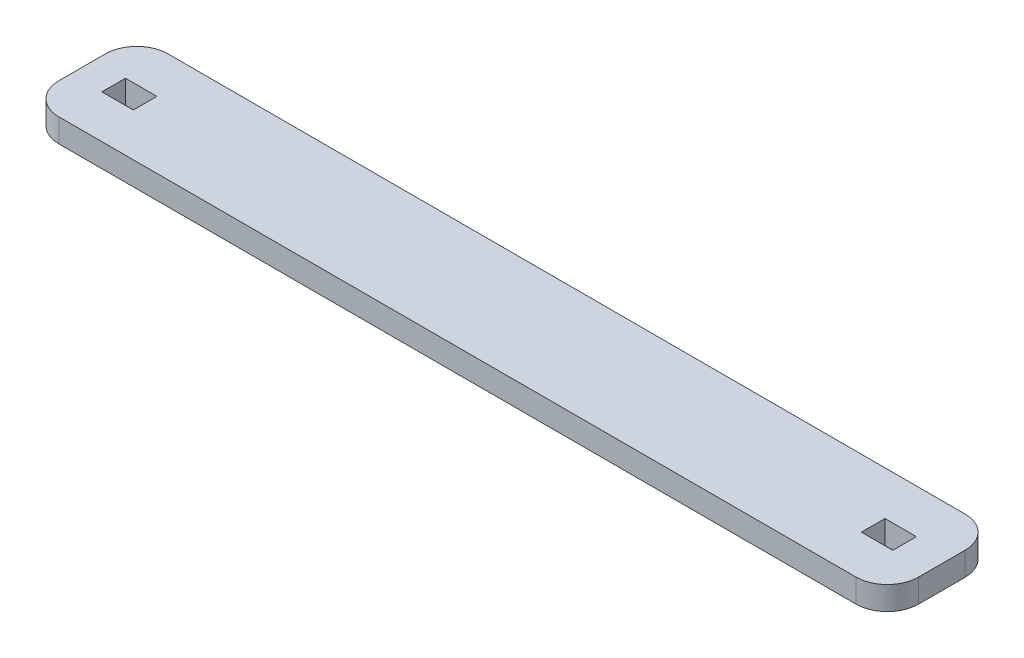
ISO-10303-21;
HEADER;
FILE_DESCRIPTION(('STEP AP214'),'2;1');
FILE_NAME('part.step','',(''),(''),'','','');
FILE_SCHEMA(('AUTOMOTIVE_DESIGN { 1 0 10303 214 1 1 1 1 }'));
ENDSEC;
DATA;
#1=APPLICATION_CONTEXT('core data for automotive mechanical design processes');
#2=APPLICATION_PROTOCOL_DEFINITION('international standard','automotive_design',2000,#1);
#3=PRODUCT_CONTEXT('',#1,'mechanical');
#4=PRODUCT('Part','Part','',(#3));
#5=PRODUCT_RELATED_PRODUCT_CATEGORY('part','',(#4));
#6=PRODUCT_DEFINITION_FORMATION('','',#4);
#7=PRODUCT_DEFINITION_CONTEXT('part definition',#1,'design');
#8=PRODUCT_DEFINITION('design','',#6,#7);
#9=PRODUCT_DEFINITION_SHAPE('','',#8);
#10=(LENGTH_UNIT() NAMED_UNIT(*) SI_UNIT(.MILLI.,.METRE.));
#11=(NAMED_UNIT(*) PLANE_ANGLE_UNIT() SI_UNIT($,.RADIAN.));
#12=(NAMED_UNIT(*) SI_UNIT($,.STERADIAN.) SOLID_ANGLE_UNIT());
#13=UNCERTAINTY_MEASURE_WITH_UNIT(LENGTH_MEASURE(1.E-05),#10,'distance_accuracy_value','');
#14=(GEOMETRIC_REPRESENTATION_CONTEXT(3) GLOBAL_UNCERTAINTY_ASSIGNED_CONTEXT((#13)) GLOBAL_UNIT_ASSIGNED_CONTEXT((#10,
#11,#12)) REPRESENTATION_CONTEXT('',''));
#15=CARTESIAN_POINT('',(0.,0.,0.));
#16=DIRECTION('',(0.,0.,1.));
#17=DIRECTION('',(1.,0.,0.));
#18=AXIS2_PLACEMENT_3D('',#15,#16,#17);
#19=CARTESIAN_POINT('',(270.47619047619,7.5,-28.8095238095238));
#20=DIRECTION('',(0.,-1.,0.));
#21=DIRECTION('',(0.,0.,-1.));
#22=AXIS2_PLACEMENT_3D('',#19,#20,#21);
#23=PLANE('',#22);
#24=DIRECTION('',(0.,0.,1.));
#25=VECTOR('',#24,1.);
#26=CARTESIAN_POINT('',(-239.610659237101,7.5,-21.7145058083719));
#27=LINE('',#26,#25);
#28=CARTESIAN_POINT('',(-239.610659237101,7.5,-21.7145058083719));
#29=VERTEX_POINT('',#28);
#30=CARTESIAN_POINT('',(-239.610659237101,7.5,-6.61450580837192));
#31=VERTEX_POINT('',#30);
#32=EDGE_CURVE('E182',#29,#31,#27,.T.);
#33=ORIENTED_EDGE('',*,*,#32,.F.);
#34=DIRECTION('',(-1.,0.,0.));
#35=VECTOR('',#34,1.);
#36=CARTESIAN_POINT('',(-239.610659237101,7.5,-21.7145058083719));
#37=LINE('',#36,#35);
#38=CARTESIAN_POINT('',(-219.510659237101,7.5,-21.7145058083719));
#39=VERTEX_POINT('',#38);
#40=EDGE_CURVE('E190',#39,#29,#37,.T.);
#41=ORIENTED_EDGE('',*,*,#40,.F.);
#42=DIRECTION('',(0.,0.,-1.));
#43=VECTOR('',#42,1.);
#44=CARTESIAN_POINT('',(-219.510659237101,7.5,-21.7145058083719));
#45=LINE('',#44,#43);
#46=CARTESIAN_POINT('',(-219.510659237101,7.5,-6.61450580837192));
#47=VERTEX_POINT('',#46);
#48=EDGE_CURVE('E187',#47,#39,#45,.T.);
#49=ORIENTED_EDGE('',*,*,#48,.F.);
#50=DIRECTION('',(1.,0.,0.));
#51=VECTOR('',#50,1.);
#52=CARTESIAN_POINT('',(-239.610659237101,7.5,-6.61450580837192));
#53=LINE('',#52,#51);
#54=EDGE_CURVE('E184',#31,#47,#53,.T.);
#55=ORIENTED_EDGE('',*,*,#54,.F.);
#56=EDGE_LOOP('',(#33,#41,#49,#55));
#57=FACE_BOUND('',#56,.T.);
#58=CARTESIAN_POINT('',(270.47619047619,7.5,-28.8095238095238));
#59=DIRECTION('',(0.,1.,0.));
#60=DIRECTION('',(0.,0.,-1.));
#61=AXIS2_PLACEMENT_3D('',#58,#59,#60);
#62=CIRCLE('',#61,20.);
#63=CARTESIAN_POINT('',(290.47619047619,7.5,-28.8095238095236));
#64=VERTEX_POINT('',#63);
#65=CARTESIAN_POINT('',(270.47619047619,7.5,-48.8095238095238));
#66=VERTEX_POINT('',#65);
#67=EDGE_CURVE('E213',#64,#66,#62,.T.);
#68=ORIENTED_EDGE('',*,*,#67,.T.);
#69=DIRECTION('',(-1.,0.,0.));
#70=VECTOR('',#69,1.);
#71=CARTESIAN_POINT('',(-239.523809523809,7.5,-48.8095238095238));
#72=LINE('',#71,#70);
#73=CARTESIAN_POINT('',(-239.523809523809,7.5,-48.8095238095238));
#74=VERTEX_POINT('',#73);
#75=EDGE_CURVE('E216',#66,#74,#72,.T.);
#76=ORIENTED_EDGE('',*,*,#75,.T.);
#77=CARTESIAN_POINT('',(-239.52380952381,7.5,-28.8095238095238));
#78=DIRECTION('',(0.,1.,0.));
#79=DIRECTION('',(0.,0.,1.));
#80=AXIS2_PLACEMENT_3D('',#77,#78,#79);
#81=CIRCLE('',#80,20.);
#82=CARTESIAN_POINT('',(-259.52380952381,7.5,-28.8095238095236));
#83=VERTEX_POINT('',#82);
#84=EDGE_CURVE('E219',#74,#83,#81,.T.);
#85=ORIENTED_EDGE('',*,*,#84,.T.);
#86=DIRECTION('',(0.,0.,1.));
#87=VECTOR('',#86,1.);
#88=CARTESIAN_POINT('',(-259.52380952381,7.5,-28.8095238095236));
#89=LINE('',#88,#87);
#90=CARTESIAN_POINT('',(-259.52380952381,7.5,0.990476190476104));
#91=VERTEX_POINT('',#90);
#92=EDGE_CURVE('E221',#83,#91,#89,.T.);
#93=ORIENTED_EDGE('',*,*,#92,.T.);
#94=CARTESIAN_POINT('',(-239.52380952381,7.5,0.990476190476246));
#95=DIRECTION('',(0.,1.,0.));
#96=DIRECTION('',(0.,0.,1.));
#97=AXIS2_PLACEMENT_3D('',#94,#95,#96);
#98=CIRCLE('',#97,20.);
#99=CARTESIAN_POINT('',(-239.52380952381,7.5,20.9904761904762));
#100=VERTEX_POINT('',#99);
#101=EDGE_CURVE('E223',#91,#100,#98,.T.);
#102=ORIENTED_EDGE('',*,*,#101,.T.);
#103=DIRECTION('',(1.,0.,0.));
#104=VECTOR('',#103,1.);
#105=CARTESIAN_POINT('',(-239.523809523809,7.5,20.9904761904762));
#106=LINE('',#105,#104);
#107=CARTESIAN_POINT('',(270.47619047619,7.5,20.9904761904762));
#108=VERTEX_POINT('',#107);
#109=EDGE_CURVE('E225',#100,#108,#106,.T.);
#110=ORIENTED_EDGE('',*,*,#109,.T.);
#111=CARTESIAN_POINT('',(270.47619047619,7.5,0.990476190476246));
#112=DIRECTION('',(0.,1.,0.));
#113=DIRECTION('',(0.,0.,1.));
#114=AXIS2_PLACEMENT_3D('',#111,#112,#113);
#115=CIRCLE('',#114,20.);
#116=CARTESIAN_POINT('',(290.47619047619,7.5,0.990476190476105));
#117=VERTEX_POINT('',#116);
#118=EDGE_CURVE('E227',#108,#117,#115,.T.);
#119=ORIENTED_EDGE('',*,*,#118,.T.);
#120=DIRECTION('',(0.,0.,-1.));
#121=VECTOR('',#120,1.);
#122=CARTESIAN_POINT('',(290.47619047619,7.5,-28.8095238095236));
#123=LINE('',#122,#121);
#124=EDGE_CURVE('E229',#117,#64,#123,.T.);
#125=ORIENTED_EDGE('',*,*,#124,.T.);
#126=EDGE_LOOP('',(#68,#76,#85,#93,#102,#110,#119,#125));
#127=FACE_BOUND('',#126,.T.);
#128=DIRECTION('',(0.,0.,1.));
#129=VECTOR('',#128,1.);
#130=CARTESIAN_POINT('',(247.285233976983,7.5,-20.7145058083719));
#131=LINE('',#130,#129);
#132=CARTESIAN_POINT('',(247.285233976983,7.5,-20.7145058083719));
#133=VERTEX_POINT('',#132);
#134=CARTESIAN_POINT('',(247.285233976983,7.5,-5.61450580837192));
#135=VERTEX_POINT('',#134);
#136=EDGE_CURVE('E146',#133,#135,#131,.T.);
#137=ORIENTED_EDGE('',*,*,#136,.F.);
#138=DIRECTION('',(-1.,0.,0.));
#139=VECTOR('',#138,1.);
#140=CARTESIAN_POINT('',(247.285233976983,7.5,-20.7145058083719));
#141=LINE('',#140,#139);
#142=CARTESIAN_POINT('',(267.385233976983,7.5,-20.7145058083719));
#143=VERTEX_POINT('',#142);
#144=EDGE_CURVE('E168',#143,#133,#141,.T.);
#145=ORIENTED_EDGE('',*,*,#144,.F.);
#146=DIRECTION('',(0.,0.,-1.));
#147=VECTOR('',#146,1.);
#148=CARTESIAN_POINT('',(267.385233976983,7.5,-20.7145058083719));
#149=LINE('',#148,#147);
#150=CARTESIAN_POINT('',(267.385233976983,7.5,-5.61450580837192));
#151=VERTEX_POINT('',#150);
#152=EDGE_CURVE('E166',#151,#143,#149,.T.);
#153=ORIENTED_EDGE('',*,*,#152,.F.);
#154=DIRECTION('',(1.,0.,0.));
#155=VECTOR('',#154,1.);
#156=CARTESIAN_POINT('',(247.285233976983,7.5,-5.61450580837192));
#157=LINE('',#156,#155);
#158=EDGE_CURVE('E154',#135,#151,#157,.T.);
#159=ORIENTED_EDGE('',*,*,#158,.F.);
#160=EDGE_LOOP('',(#137,#145,#153,#159));
#161=FACE_BOUND('',#160,.T.);
#162=ADVANCED_FACE('F33',(#57,#127,#161),#23,.F.);
#163=CARTESIAN_POINT('',(270.47619047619,-7.5,-28.8095238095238));
#164=DIRECTION('',(0.,-1.,0.));
#165=DIRECTION('',(0.,0.,-1.));
#166=AXIS2_PLACEMENT_3D('',#163,#164,#165);
#167=PLANE('',#166);
#168=CARTESIAN_POINT('',(270.47619047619,-7.5,-28.8095238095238));
#169=DIRECTION('',(0.,1.,0.));
#170=DIRECTION('',(0.,0.,-1.));
#171=AXIS2_PLACEMENT_3D('',#168,#169,#170);
#172=CIRCLE('',#171,20.);
#173=CARTESIAN_POINT('',(290.47619047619,-7.5,-28.8095238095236));
#174=VERTEX_POINT('',#173);
#175=CARTESIAN_POINT('',(270.47619047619,-7.5,-48.8095238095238));
#176=VERTEX_POINT('',#175);
#177=EDGE_CURVE('E212',#174,#176,#172,.T.);
#178=ORIENTED_EDGE('',*,*,#177,.F.);
#179=DIRECTION('',(0.,0.,-1.));
#180=VECTOR('',#179,1.);
#181=CARTESIAN_POINT('',(290.47619047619,-7.5,-28.8095238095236));
#182=LINE('',#181,#180);
#183=CARTESIAN_POINT('',(290.47619047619,-7.5,0.990476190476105));
#184=VERTEX_POINT('',#183);
#185=EDGE_CURVE('E217',#184,#174,#182,.T.);
#186=ORIENTED_EDGE('',*,*,#185,.F.);
#187=CARTESIAN_POINT('',(270.47619047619,-7.5,0.990476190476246));
#188=DIRECTION('',(0.,1.,0.));
#189=DIRECTION('',(0.,0.,1.));
#190=AXIS2_PLACEMENT_3D('',#187,#188,#189);
#191=CIRCLE('',#190,20.);
#192=CARTESIAN_POINT('',(270.47619047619,-7.5,20.9904761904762));
#193=VERTEX_POINT('',#192);
#194=EDGE_CURVE('E244',#193,#184,#191,.T.);
#195=ORIENTED_EDGE('',*,*,#194,.F.);
#196=DIRECTION('',(1.,0.,0.));
#197=VECTOR('',#196,1.);
#198=CARTESIAN_POINT('',(-239.523809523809,-7.5,20.9904761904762));
#199=LINE('',#198,#197);
#200=CARTESIAN_POINT('',(-239.52380952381,-7.5,20.9904761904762));
#201=VERTEX_POINT('',#200);
#202=EDGE_CURVE('E242',#201,#193,#199,.T.);
#203=ORIENTED_EDGE('',*,*,#202,.F.);
#204=CARTESIAN_POINT('',(-239.52380952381,-7.5,0.990476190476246));
#205=DIRECTION('',(0.,1.,0.));
#206=DIRECTION('',(0.,0.,1.));
#207=AXIS2_PLACEMENT_3D('',#204,#205,#206);
#208=CIRCLE('',#207,20.);
#209=CARTESIAN_POINT('',(-259.52380952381,-7.5,0.990476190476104));
#210=VERTEX_POINT('',#209);
#211=EDGE_CURVE('E240',#210,#201,#208,.T.);
#212=ORIENTED_EDGE('',*,*,#211,.F.);
#213=DIRECTION('',(0.,0.,1.));
#214=VECTOR('',#213,1.);
#215=CARTESIAN_POINT('',(-259.52380952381,-7.5,-28.8095238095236));
#216=LINE('',#215,#214);
#217=CARTESIAN_POINT('',(-259.52380952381,-7.5,-28.8095238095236));
#218=VERTEX_POINT('',#217);
#219=EDGE_CURVE('E238',#218,#210,#216,.T.);
#220=ORIENTED_EDGE('',*,*,#219,.F.);
#221=CARTESIAN_POINT('',(-239.52380952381,-7.5,-28.8095238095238));
#222=DIRECTION('',(0.,1.,0.));
#223=DIRECTION('',(0.,0.,1.));
#224=AXIS2_PLACEMENT_3D('',#221,#222,#223);
#225=CIRCLE('',#224,20.);
#226=CARTESIAN_POINT('',(-239.523809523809,-7.5,-48.8095238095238));
#227=VERTEX_POINT('',#226);
#228=EDGE_CURVE('E236',#227,#218,#225,.T.);
#229=ORIENTED_EDGE('',*,*,#228,.F.);
#230=DIRECTION('',(-1.,0.,0.));
#231=VECTOR('',#230,1.);
#232=CARTESIAN_POINT('',(-239.523809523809,-7.5,-48.8095238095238));
#233=LINE('',#232,#231);
#234=EDGE_CURVE('E234',#176,#227,#233,.T.);
#235=ORIENTED_EDGE('',*,*,#234,.F.);
#236=EDGE_LOOP('',(#178,#186,#195,#203,#212,#220,#229,#235));
#237=FACE_BOUND('',#236,.T.);
#238=DIRECTION('',(-1.,0.,0.));
#239=VECTOR('',#238,1.);
#240=CARTESIAN_POINT('',(-239.610659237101,-7.5,-21.7145058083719));
#241=LINE('',#240,#239);
#242=CARTESIAN_POINT('',(-219.510659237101,-7.5,-21.7145058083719));
#243=VERTEX_POINT('',#242);
#244=CARTESIAN_POINT('',(-239.610659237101,-7.5,-21.7145058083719));
#245=VERTEX_POINT('',#244);
#246=EDGE_CURVE('E185',#243,#245,#241,.T.);
#247=ORIENTED_EDGE('',*,*,#246,.T.);
#248=DIRECTION('',(0.,0.,1.));
#249=VECTOR('',#248,1.);
#250=CARTESIAN_POINT('',(-239.610659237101,-7.5,-21.7145058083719));
#251=LINE('',#250,#249);
#252=CARTESIAN_POINT('',(-239.610659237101,-7.5,-6.61450580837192));
#253=VERTEX_POINT('',#252);
#254=EDGE_CURVE('E162',#245,#253,#251,.T.);
#255=ORIENTED_EDGE('',*,*,#254,.T.);
#256=DIRECTION('',(1.,0.,0.));
#257=VECTOR('',#256,1.);
#258=CARTESIAN_POINT('',(-239.610659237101,-7.5,-6.61450580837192));
#259=LINE('',#258,#257);
#260=CARTESIAN_POINT('',(-219.510659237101,-7.5,-6.61450580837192));
#261=VERTEX_POINT('',#260);
#262=EDGE_CURVE('E195',#253,#261,#259,.T.);
#263=ORIENTED_EDGE('',*,*,#262,.T.);
#264=DIRECTION('',(0.,0.,-1.));
#265=VECTOR('',#264,1.);
#266=CARTESIAN_POINT('',(-219.510659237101,-7.5,-21.7145058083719));
#267=LINE('',#266,#265);
#268=EDGE_CURVE('E198',#261,#243,#267,.T.);
#269=ORIENTED_EDGE('',*,*,#268,.T.);
#270=EDGE_LOOP('',(#247,#255,#263,#269));
#271=FACE_BOUND('',#270,.T.);
#272=DIRECTION('',(-1.,0.,0.));
#273=VECTOR('',#272,1.);
#274=CARTESIAN_POINT('',(247.285233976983,-7.5,-20.7145058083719));
#275=LINE('',#274,#273);
#276=CARTESIAN_POINT('',(267.385233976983,-7.5,-20.7145058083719));
#277=VERTEX_POINT('',#276);
#278=CARTESIAN_POINT('',(247.285233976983,-7.5,-20.7145058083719));
#279=VERTEX_POINT('',#278);
#280=EDGE_CURVE('E155',#277,#279,#275,.T.);
#281=ORIENTED_EDGE('',*,*,#280,.T.);
#282=DIRECTION('',(0.,0.,1.));
#283=VECTOR('',#282,1.);
#284=CARTESIAN_POINT('',(247.285233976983,-7.5,-20.7145058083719));
#285=LINE('',#284,#283);
#286=CARTESIAN_POINT('',(247.285233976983,-7.5,-5.61450580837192));
#287=VERTEX_POINT('',#286);
#288=EDGE_CURVE('E56',#279,#287,#285,.T.);
#289=ORIENTED_EDGE('',*,*,#288,.T.);
#290=DIRECTION('',(1.,0.,0.));
#291=VECTOR('',#290,1.);
#292=CARTESIAN_POINT('',(247.285233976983,-7.5,-5.61450580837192));
#293=LINE('',#292,#291);
#294=CARTESIAN_POINT('',(267.385233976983,-7.5,-5.61450580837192));
#295=VERTEX_POINT('',#294);
#296=EDGE_CURVE('E161',#287,#295,#293,.T.);
#297=ORIENTED_EDGE('',*,*,#296,.T.);
#298=DIRECTION('',(0.,0.,-1.));
#299=VECTOR('',#298,1.);
#300=CARTESIAN_POINT('',(267.385233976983,-7.5,-20.7145058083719));
#301=LINE('',#300,#299);
#302=EDGE_CURVE('E174',#295,#277,#301,.T.);
#303=ORIENTED_EDGE('',*,*,#302,.T.);
#304=EDGE_LOOP('',(#281,#289,#297,#303));
#305=FACE_BOUND('',#304,.T.);
#306=ADVANCED_FACE('F274',(#237,#271,#305),#167,.T.);
#307=CARTESIAN_POINT('',(270.47619047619,7.5,-28.8095238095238));
#308=DIRECTION('',(0.,-1.,0.));
#309=DIRECTION('',(0.,0.,-1.));
#310=AXIS2_PLACEMENT_3D('',#307,#308,#309);
#311=CYLINDRICAL_SURFACE('',#310,20.);
#312=ORIENTED_EDGE('',*,*,#177,.T.);
#313=DIRECTION('',(0.,-1.,0.));
#314=VECTOR('',#313,1.);
#315=CARTESIAN_POINT('',(270.47619047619,7.5,-48.8095238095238));
#316=LINE('',#315,#314);
#317=EDGE_CURVE('E11',#66,#176,#316,.T.);
#318=ORIENTED_EDGE('',*,*,#317,.F.);
#319=ORIENTED_EDGE('',*,*,#67,.F.);
#320=DIRECTION('',(0.,-1.,0.));
#321=VECTOR('',#320,1.);
#322=CARTESIAN_POINT('',(290.47619047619,7.5,-28.8095238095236));
#323=LINE('',#322,#321);
#324=EDGE_CURVE('E231',#64,#174,#323,.T.);
#325=ORIENTED_EDGE('',*,*,#324,.T.);
#326=EDGE_LOOP('',(#312,#318,#319,#325));
#327=FACE_BOUND('',#326,.T.);
#328=ADVANCED_FACE('F35',(#327),#311,.T.);
#329=CARTESIAN_POINT('',(-239.523809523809,7.5,-48.8095238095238));
#330=DIRECTION('',(0.,0.,1.));
#331=DIRECTION('',(1.,0.,0.));
#332=AXIS2_PLACEMENT_3D('',#329,#330,#331);
#333=PLANE('',#332);
#334=ORIENTED_EDGE('',*,*,#234,.T.);
#335=DIRECTION('',(0.,-1.,0.));
#336=VECTOR('',#335,1.);
#337=CARTESIAN_POINT('',(-239.523809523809,7.5,-48.8095238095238));
#338=LINE('',#337,#336);
#339=EDGE_CURVE('E41',#74,#227,#338,.T.);
#340=ORIENTED_EDGE('',*,*,#339,.F.);
#341=ORIENTED_EDGE('',*,*,#75,.F.);
#342=ORIENTED_EDGE('',*,*,#317,.T.);
#343=EDGE_LOOP('',(#334,#340,#341,#342));
#344=FACE_BOUND('',#343,.T.);
#345=ADVANCED_FACE('F291',(#344),#333,.F.);
#346=CARTESIAN_POINT('',(-239.52380952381,7.5,-28.8095238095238));
#347=DIRECTION('',(0.,-1.,0.));
#348=DIRECTION('',(0.,0.,-1.));
#349=AXIS2_PLACEMENT_3D('',#346,#347,#348);
#350=CYLINDRICAL_SURFACE('',#349,20.);
#351=ORIENTED_EDGE('',*,*,#228,.T.);
#352=DIRECTION('',(0.,-1.,0.));
#353=VECTOR('',#352,1.);
#354=CARTESIAN_POINT('',(-259.52380952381,7.5,-28.8095238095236));
#355=LINE('',#354,#353);
#356=EDGE_CURVE('E261',#83,#218,#355,.T.);
#357=ORIENTED_EDGE('',*,*,#356,.F.);
#358=ORIENTED_EDGE('',*,*,#84,.F.);
#359=ORIENTED_EDGE('',*,*,#339,.T.);
#360=EDGE_LOOP('',(#351,#357,#358,#359));
#361=FACE_BOUND('',#360,.T.);
#362=ADVANCED_FACE('F268',(#361),#350,.T.);
#363=CARTESIAN_POINT('',(-259.52380952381,7.5,-28.8095238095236));
#364=DIRECTION('',(1.,0.,0.));
#365=DIRECTION('',(0.,0.,-1.));
#366=AXIS2_PLACEMENT_3D('',#363,#364,#365);
#367=PLANE('',#366);
#368=ORIENTED_EDGE('',*,*,#219,.T.);
#369=DIRECTION('',(0.,-1.,0.));
#370=VECTOR('',#369,1.);
#371=CARTESIAN_POINT('',(-259.52380952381,7.5,0.990476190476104));
#372=LINE('',#371,#370);
#373=EDGE_CURVE('E258',#91,#210,#372,.T.);
#374=ORIENTED_EDGE('',*,*,#373,.F.);
#375=ORIENTED_EDGE('',*,*,#92,.F.);
#376=ORIENTED_EDGE('',*,*,#356,.T.);
#377=EDGE_LOOP('',(#368,#374,#375,#376));
#378=FACE_BOUND('',#377,.T.);
#379=ADVANCED_FACE('F280',(#378),#367,.F.);
#380=CARTESIAN_POINT('',(-239.52380952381,7.5,0.990476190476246));
#381=DIRECTION('',(0.,-1.,0.));
#382=DIRECTION('',(0.,0.,-1.));
#383=AXIS2_PLACEMENT_3D('',#380,#381,#382);
#384=CYLINDRICAL_SURFACE('',#383,20.);
#385=ORIENTED_EDGE('',*,*,#211,.T.);
#386=DIRECTION('',(0.,-1.,0.));
#387=VECTOR('',#386,1.);
#388=CARTESIAN_POINT('',(-239.52380952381,7.5,20.9904761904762));
#389=LINE('',#388,#387);
#390=EDGE_CURVE('E255',#100,#201,#389,.T.);
#391=ORIENTED_EDGE('',*,*,#390,.F.);
#392=ORIENTED_EDGE('',*,*,#101,.F.);
#393=ORIENTED_EDGE('',*,*,#373,.T.);
#394=EDGE_LOOP('',(#385,#391,#392,#393));
#395=FACE_BOUND('',#394,.T.);
#396=ADVANCED_FACE('F284',(#395),#384,.T.);
#397=CARTESIAN_POINT('',(-239.523809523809,7.5,20.9904761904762));
#398=DIRECTION('',(0.,0.,-1.));
#399=DIRECTION('',(-1.,0.,0.));
#400=AXIS2_PLACEMENT_3D('',#397,#398,#399);
#401=PLANE('',#400);
#402=ORIENTED_EDGE('',*,*,#202,.T.);
#403=DIRECTION('',(0.,-1.,0.));
#404=VECTOR('',#403,1.);
#405=CARTESIAN_POINT('',(270.47619047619,7.5,20.9904761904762));
#406=LINE('',#405,#404);
#407=EDGE_CURVE('E252',#108,#193,#406,.T.);
#408=ORIENTED_EDGE('',*,*,#407,.F.);
#409=ORIENTED_EDGE('',*,*,#109,.F.);
#410=ORIENTED_EDGE('',*,*,#390,.T.);
#411=EDGE_LOOP('',(#402,#408,#409,#410));
#412=FACE_BOUND('',#411,.T.);
#413=ADVANCED_FACE('F304',(#412),#401,.F.);
#414=CARTESIAN_POINT('',(270.47619047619,7.5,0.990476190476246));
#415=DIRECTION('',(0.,-1.,0.));
#416=DIRECTION('',(0.,0.,-1.));
#417=AXIS2_PLACEMENT_3D('',#414,#415,#416);
#418=CYLINDRICAL_SURFACE('',#417,20.);
#419=ORIENTED_EDGE('',*,*,#194,.T.);
#420=DIRECTION('',(0.,-1.,0.));
#421=VECTOR('',#420,1.);
#422=CARTESIAN_POINT('',(290.47619047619,7.5,0.990476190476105));
#423=LINE('',#422,#421);
#424=EDGE_CURVE('E249',#117,#184,#423,.T.);
#425=ORIENTED_EDGE('',*,*,#424,.F.);
#426=ORIENTED_EDGE('',*,*,#118,.F.);
#427=ORIENTED_EDGE('',*,*,#407,.T.);
#428=EDGE_LOOP('',(#419,#425,#426,#427));
#429=FACE_BOUND('',#428,.T.);
#430=ADVANCED_FACE('F302',(#429),#418,.T.);
#431=CARTESIAN_POINT('',(290.47619047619,7.5,-28.8095238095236));
#432=DIRECTION('',(-1.,0.,0.));
#433=DIRECTION('',(0.,0.,1.));
#434=AXIS2_PLACEMENT_3D('',#431,#432,#433);
#435=PLANE('',#434);
#436=ORIENTED_EDGE('',*,*,#185,.T.);
#437=ORIENTED_EDGE('',*,*,#324,.F.);
#438=ORIENTED_EDGE('',*,*,#124,.F.);
#439=ORIENTED_EDGE('',*,*,#424,.T.);
#440=EDGE_LOOP('',(#436,#437,#438,#439));
#441=FACE_BOUND('',#440,.T.);
#442=ADVANCED_FACE('F297',(#441),#435,.F.);
#443=CARTESIAN_POINT('',(-239.610659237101,7.5,-21.7145058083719));
#444=DIRECTION('',(1.,0.,0.));
#445=DIRECTION('',(0.,0.,-1.));
#446=AXIS2_PLACEMENT_3D('',#443,#444,#445);
#447=PLANE('',#446);
#448=ORIENTED_EDGE('',*,*,#254,.F.);
#449=DIRECTION('',(0.,-1.,0.));
#450=VECTOR('',#449,1.);
#451=CARTESIAN_POINT('',(-239.610659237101,7.5,-21.7145058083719));
#452=LINE('',#451,#450);
#453=EDGE_CURVE('E192',#29,#245,#452,.T.);
#454=ORIENTED_EDGE('',*,*,#453,.F.);
#455=ORIENTED_EDGE('',*,*,#32,.T.);
#456=DIRECTION('',(0.,-1.,0.));
#457=VECTOR('',#456,1.);
#458=CARTESIAN_POINT('',(-239.610659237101,7.5,-6.61450580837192));
#459=LINE('',#458,#457);
#460=EDGE_CURVE('E209',#31,#253,#459,.T.);
#461=ORIENTED_EDGE('',*,*,#460,.T.);
#462=EDGE_LOOP('',(#448,#454,#455,#461));
#463=FACE_BOUND('',#462,.T.);
#464=ADVANCED_FACE('F322',(#463),#447,.T.);
#465=CARTESIAN_POINT('',(-239.610659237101,7.5,-6.61450580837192));
#466=DIRECTION('',(0.,0.,-1.));
#467=DIRECTION('',(-1.,0.,0.));
#468=AXIS2_PLACEMENT_3D('',#465,#466,#467);
#469=PLANE('',#468);
#470=ORIENTED_EDGE('',*,*,#262,.F.);
#471=ORIENTED_EDGE('',*,*,#460,.F.);
#472=ORIENTED_EDGE('',*,*,#54,.T.);
#473=DIRECTION('',(0.,-1.,0.));
#474=VECTOR('',#473,1.);
#475=CARTESIAN_POINT('',(-219.510659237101,7.5,-6.61450580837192));
#476=LINE('',#475,#474);
#477=EDGE_CURVE('E207',#47,#261,#476,.T.);
#478=ORIENTED_EDGE('',*,*,#477,.T.);
#479=EDGE_LOOP('',(#470,#471,#472,#478));
#480=FACE_BOUND('',#479,.T.);
#481=ADVANCED_FACE('F329',(#480),#469,.T.);
#482=CARTESIAN_POINT('',(-219.510659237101,7.5,-21.7145058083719));
#483=DIRECTION('',(-1.,0.,0.));
#484=DIRECTION('',(0.,0.,1.));
#485=AXIS2_PLACEMENT_3D('',#482,#483,#484);
#486=PLANE('',#485);
#487=ORIENTED_EDGE('',*,*,#268,.F.);
#488=ORIENTED_EDGE('',*,*,#477,.F.);
#489=ORIENTED_EDGE('',*,*,#48,.T.);
#490=DIRECTION('',(0.,-1.,0.));
#491=VECTOR('',#490,1.);
#492=CARTESIAN_POINT('',(-219.510659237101,7.5,-21.7145058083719));
#493=LINE('',#492,#491);
#494=EDGE_CURVE('E205',#39,#243,#493,.T.);
#495=ORIENTED_EDGE('',*,*,#494,.T.);
#496=EDGE_LOOP('',(#487,#488,#489,#495));
#497=FACE_BOUND('',#496,.T.);
#498=ADVANCED_FACE('F334',(#497),#486,.T.);
#499=CARTESIAN_POINT('',(-239.610659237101,7.5,-21.7145058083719));
#500=DIRECTION('',(0.,0.,1.));
#501=DIRECTION('',(1.,0.,0.));
#502=AXIS2_PLACEMENT_3D('',#499,#500,#501);
#503=PLANE('',#502);
#504=ORIENTED_EDGE('',*,*,#246,.F.);
#505=ORIENTED_EDGE('',*,*,#494,.F.);
#506=ORIENTED_EDGE('',*,*,#40,.T.);
#507=ORIENTED_EDGE('',*,*,#453,.T.);
#508=EDGE_LOOP('',(#504,#505,#506,#507));
#509=FACE_BOUND('',#508,.T.);
#510=ADVANCED_FACE('F340',(#509),#503,.T.);
#511=CARTESIAN_POINT('',(247.285233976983,7.5,-20.7145058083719));
#512=DIRECTION('',(1.,0.,0.));
#513=DIRECTION('',(0.,0.,-1.));
#514=AXIS2_PLACEMENT_3D('',#511,#512,#513);
#515=PLANE('',#514);
#516=ORIENTED_EDGE('',*,*,#288,.F.);
#517=DIRECTION('',(0.,-1.,0.));
#518=VECTOR('',#517,1.);
#519=CARTESIAN_POINT('',(247.285233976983,7.5,-20.7145058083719));
#520=LINE('',#519,#518);
#521=EDGE_CURVE('E150',#133,#279,#520,.T.);
#522=ORIENTED_EDGE('',*,*,#521,.F.);
#523=ORIENTED_EDGE('',*,*,#136,.T.);
#524=DIRECTION('',(0.,-1.,0.));
#525=VECTOR('',#524,1.);
#526=CARTESIAN_POINT('',(247.285233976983,7.5,-5.61450580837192));
#527=LINE('',#526,#525);
#528=EDGE_CURVE('E149',#135,#287,#527,.T.);
#529=ORIENTED_EDGE('',*,*,#528,.T.);
#530=EDGE_LOOP('',(#516,#522,#523,#529));
#531=FACE_BOUND('',#530,.T.);
#532=ADVANCED_FACE('F148',(#531),#515,.T.);
#533=CARTESIAN_POINT('',(247.285233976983,7.5,-5.61450580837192));
#534=DIRECTION('',(0.,0.,-1.));
#535=DIRECTION('',(-1.,0.,0.));
#536=AXIS2_PLACEMENT_3D('',#533,#534,#535);
#537=PLANE('',#536);
#538=ORIENTED_EDGE('',*,*,#296,.F.);
#539=ORIENTED_EDGE('',*,*,#528,.F.);
#540=ORIENTED_EDGE('',*,*,#158,.T.);
#541=DIRECTION('',(0.,-1.,0.));
#542=VECTOR('',#541,1.);
#543=CARTESIAN_POINT('',(267.385233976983,7.5,-5.61450580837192));
#544=LINE('',#543,#542);
#545=EDGE_CURVE('E163',#151,#295,#544,.T.);
#546=ORIENTED_EDGE('',*,*,#545,.T.);
#547=EDGE_LOOP('',(#538,#539,#540,#546));
#548=FACE_BOUND('',#547,.T.);
#549=ADVANCED_FACE('F158',(#548),#537,.T.);
#550=CARTESIAN_POINT('',(267.385233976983,7.5,-20.7145058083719));
#551=DIRECTION('',(-1.,0.,0.));
#552=DIRECTION('',(0.,0.,1.));
#553=AXIS2_PLACEMENT_3D('',#550,#551,#552);
#554=PLANE('',#553);
#555=ORIENTED_EDGE('',*,*,#302,.F.);
#556=ORIENTED_EDGE('',*,*,#545,.F.);
#557=ORIENTED_EDGE('',*,*,#152,.T.);
#558=DIRECTION('',(0.,-1.,0.));
#559=VECTOR('',#558,1.);
#560=CARTESIAN_POINT('',(267.385233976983,7.5,-20.7145058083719));
#561=LINE('',#560,#559);
#562=EDGE_CURVE('E48',#143,#277,#561,.T.);
#563=ORIENTED_EDGE('',*,*,#562,.T.);
#564=EDGE_LOOP('',(#555,#556,#557,#563));
#565=FACE_BOUND('',#564,.T.);
#566=ADVANCED_FACE('F359',(#565),#554,.T.);
#567=CARTESIAN_POINT('',(247.285233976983,7.5,-20.7145058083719));
#568=DIRECTION('',(0.,0.,1.));
#569=DIRECTION('',(1.,0.,0.));
#570=AXIS2_PLACEMENT_3D('',#567,#568,#569);
#571=PLANE('',#570);
#572=ORIENTED_EDGE('',*,*,#280,.F.);
#573=ORIENTED_EDGE('',*,*,#562,.F.);
#574=ORIENTED_EDGE('',*,*,#144,.T.);
#575=ORIENTED_EDGE('',*,*,#521,.T.);
#576=EDGE_LOOP('',(#572,#573,#574,#575));
#577=FACE_BOUND('',#576,.T.);
#578=ADVANCED_FACE('F362',(#577),#571,.T.);
#579=CLOSED_SHELL('',(#162,#306,#328,#345,#362,#379,#396,#413,#430,#442,#464,#481,#498,#510,
#532,#549,#566,#578));
#580=MANIFOLD_SOLID_BREP('B2',#579);
#581=ADVANCED_BREP_SHAPE_REPRESENTATION('',(#18,#580),#14);
#582=SHAPE_DEFINITION_REPRESENTATION(#9,#581);
ENDSEC;
END-ISO-10303-21;
